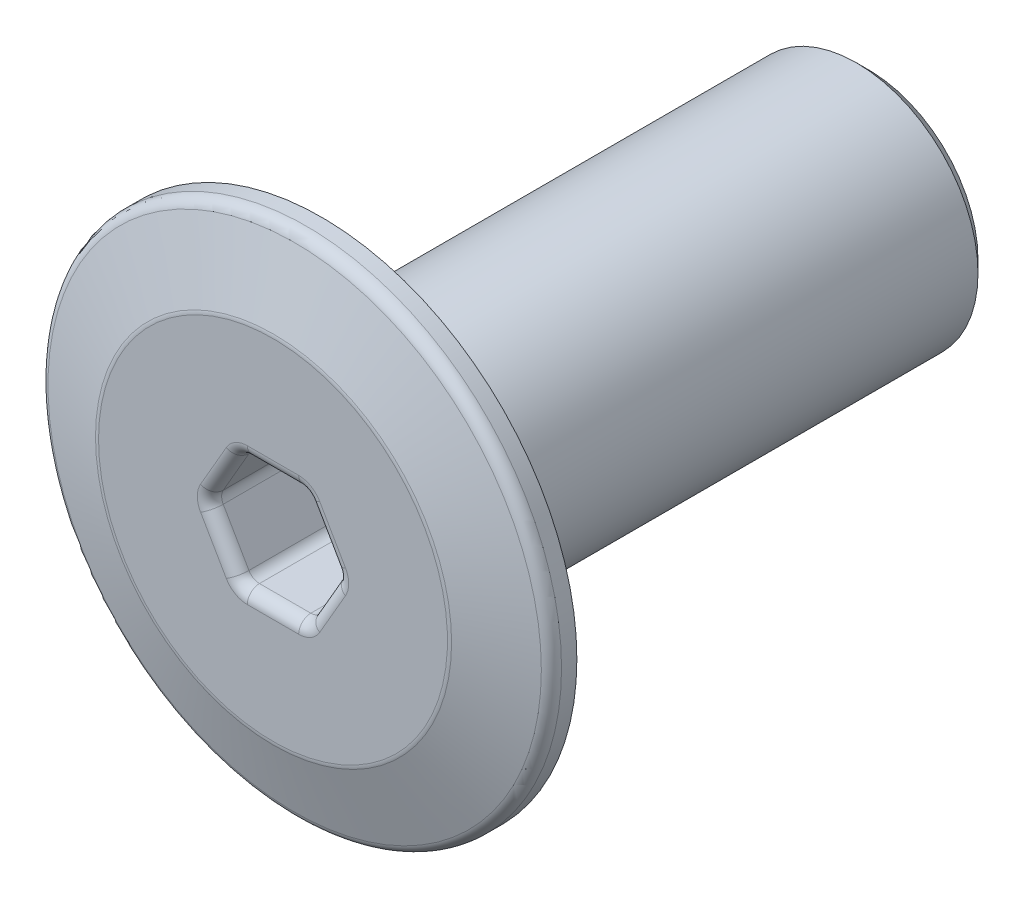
ISO-10303-21;
HEADER;
FILE_DESCRIPTION(('STEP AP214'),'2;1');
FILE_NAME('part.step','',(''),(''),'','','');
FILE_SCHEMA(('AUTOMOTIVE_DESIGN { 1 0 10303 214 1 1 1 1 }'));
ENDSEC;
DATA;
#1=APPLICATION_CONTEXT('core data for automotive mechanical design processes');
#2=APPLICATION_PROTOCOL_DEFINITION('international standard','automotive_design',2000,#1);
#3=PRODUCT_CONTEXT('',#1,'mechanical');
#4=PRODUCT('Part','Part','',(#3));
#5=PRODUCT_RELATED_PRODUCT_CATEGORY('part','',(#4));
#6=PRODUCT_DEFINITION_FORMATION('','',#4);
#7=PRODUCT_DEFINITION_CONTEXT('part definition',#1,'design');
#8=PRODUCT_DEFINITION('design','',#6,#7);
#9=PRODUCT_DEFINITION_SHAPE('','',#8);
#10=(LENGTH_UNIT() NAMED_UNIT(*) SI_UNIT(.MILLI.,.METRE.));
#11=(NAMED_UNIT(*) PLANE_ANGLE_UNIT() SI_UNIT($,.RADIAN.));
#12=(NAMED_UNIT(*) SI_UNIT($,.STERADIAN.) SOLID_ANGLE_UNIT());
#13=UNCERTAINTY_MEASURE_WITH_UNIT(LENGTH_MEASURE(1.E-05),#10,'distance_accuracy_value','');
#14=(GEOMETRIC_REPRESENTATION_CONTEXT(3) GLOBAL_UNCERTAINTY_ASSIGNED_CONTEXT((#13)) GLOBAL_UNIT_ASSIGNED_CONTEXT((#10,
#11,#12)) REPRESENTATION_CONTEXT('',''));
#15=CARTESIAN_POINT('',(0.,0.,0.));
#16=DIRECTION('',(0.,0.,1.));
#17=DIRECTION('',(1.,0.,0.));
#18=AXIS2_PLACEMENT_3D('',#15,#16,#17);
#19=CARTESIAN_POINT('',(1.5849364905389,0.915063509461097,-3.51282051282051));
#20=DIRECTION('',(0.5,-0.866025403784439,0.));
#21=DIRECTION('',(0.866025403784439,0.5,0.));
#22=AXIS2_PLACEMENT_3D('',#19,#20,#21);
#23=CYLINDRICAL_SURFACE('',#22,0.5);
#24=DIRECTION('',(-0.5,0.866025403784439,0.));
#25=VECTOR('',#24,1.);
#26=CARTESIAN_POINT('',(2.01794919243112,1.1650635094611,-3.51282051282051));
#27=LINE('',#26,#25);
#28=CARTESIAN_POINT('',(1.48963702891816,2.08012701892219,-3.51282051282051));
#29=VERTEX_POINT('',#28);
#30=CARTESIAN_POINT('',(2.54626135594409,0.25,-3.51282051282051));
#31=VERTEX_POINT('',#30);
#32=EDGE_CURVE('E353',#29,#31,#27,.F.);
#33=ORIENTED_EDGE('',*,*,#32,.F.);
#34=CARTESIAN_POINT('',(1.05662432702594,1.83012701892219,-3.51282051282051));
#35=DIRECTION('',(0.5,-0.866025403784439,0.));
#36=DIRECTION('',(0.866025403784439,0.5,0.));
#37=AXIS2_PLACEMENT_3D('',#34,#35,#36);
#38=CIRCLE('',#37,0.5);
#39=CARTESIAN_POINT('',(1.05662432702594,1.83012701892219,-4.01282051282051));
#40=VERTEX_POINT('',#39);
#41=EDGE_CURVE('E210',#29,#40,#38,.F.);
#42=ORIENTED_EDGE('',*,*,#41,.T.);
#43=DIRECTION('',(-0.5,0.866025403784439,0.));
#44=VECTOR('',#43,1.);
#45=CARTESIAN_POINT('',(1.5849364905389,0.915063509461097,-4.01282051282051));
#46=LINE('',#45,#44);
#47=CARTESIAN_POINT('',(2.11324865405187,0.,-4.01282051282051));
#48=VERTEX_POINT('',#47);
#49=EDGE_CURVE('E199',#48,#40,#46,.T.);
#50=ORIENTED_EDGE('',*,*,#49,.F.);
#51=CARTESIAN_POINT('',(2.11324865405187,0.,-3.51282051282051));
#52=DIRECTION('',(0.5,-0.866025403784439,0.));
#53=DIRECTION('',(0.866025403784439,0.5,0.));
#54=AXIS2_PLACEMENT_3D('',#51,#52,#53);
#55=CIRCLE('',#54,0.5);
#56=EDGE_CURVE('E207',#48,#31,#55,.T.);
#57=ORIENTED_EDGE('',*,*,#56,.T.);
#58=EDGE_LOOP('',(#33,#42,#50,#57));
#59=FACE_BOUND('',#58,.T.);
#60=ADVANCED_FACE('F36',(#59),#23,.F.);
#61=CARTESIAN_POINT('',(1.5849364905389,-0.915063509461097,-3.51282051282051));
#62=DIRECTION('',(-0.5,-0.866025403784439,0.));
#63=DIRECTION('',(0.866025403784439,-0.5,0.));
#64=AXIS2_PLACEMENT_3D('',#61,#62,#63);
#65=CYLINDRICAL_SURFACE('',#64,0.5);
#66=DIRECTION('',(0.5,0.866025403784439,0.));
#67=VECTOR('',#66,1.);
#68=CARTESIAN_POINT('',(2.01794919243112,-1.1650635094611,-3.51282051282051));
#69=LINE('',#68,#67);
#70=CARTESIAN_POINT('',(2.54626135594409,-0.249999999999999,-3.51282051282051));
#71=VERTEX_POINT('',#70);
#72=CARTESIAN_POINT('',(1.48963702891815,-2.08012701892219,-3.51282051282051));
#73=VERTEX_POINT('',#72);
#74=EDGE_CURVE('E185',#71,#73,#69,.F.);
#75=ORIENTED_EDGE('',*,*,#74,.F.);
#76=CARTESIAN_POINT('',(2.11324865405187,0.,-3.51282051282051));
#77=DIRECTION('',(-0.5,-0.866025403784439,0.));
#78=DIRECTION('',(0.866025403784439,-0.5,0.));
#79=AXIS2_PLACEMENT_3D('',#76,#77,#78);
#80=CIRCLE('',#79,0.5);
#81=EDGE_CURVE('E179',#71,#48,#80,.F.);
#82=ORIENTED_EDGE('',*,*,#81,.T.);
#83=DIRECTION('',(0.5,0.866025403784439,0.));
#84=VECTOR('',#83,1.);
#85=CARTESIAN_POINT('',(1.5849364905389,-0.915063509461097,-4.01282051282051));
#86=LINE('',#85,#84);
#87=CARTESIAN_POINT('',(1.05662432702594,-1.83012701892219,-4.01282051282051));
#88=VERTEX_POINT('',#87);
#89=EDGE_CURVE('E182',#88,#48,#86,.T.);
#90=ORIENTED_EDGE('',*,*,#89,.F.);
#91=CARTESIAN_POINT('',(1.05662432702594,-1.83012701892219,-3.51282051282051));
#92=DIRECTION('',(-0.5,-0.866025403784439,0.));
#93=DIRECTION('',(0.866025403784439,-0.5,0.));
#94=AXIS2_PLACEMENT_3D('',#91,#92,#93);
#95=CIRCLE('',#94,0.5);
#96=EDGE_CURVE('E191',#88,#73,#95,.T.);
#97=ORIENTED_EDGE('',*,*,#96,.T.);
#98=EDGE_LOOP('',(#75,#82,#90,#97));
#99=FACE_BOUND('',#98,.T.);
#100=ADVANCED_FACE('F181',(#99),#65,.F.);
#101=CARTESIAN_POINT('',(0.,-1.83012701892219,-3.51282051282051));
#102=DIRECTION('',(-1.,0.,0.));
#103=DIRECTION('',(0.,0.,1.));
#104=AXIS2_PLACEMENT_3D('',#101,#102,#103);
#105=CYLINDRICAL_SURFACE('',#104,0.5);
#106=DIRECTION('',(1.,0.,0.));
#107=VECTOR('',#106,1.);
#108=CARTESIAN_POINT('',(0.,-2.33012701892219,-3.51282051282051));
#109=LINE('',#108,#107);
#110=CARTESIAN_POINT('',(1.05662432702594,-2.33012701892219,-3.51282051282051));
#111=VERTEX_POINT('',#110);
#112=CARTESIAN_POINT('',(-1.05662432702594,-2.33012701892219,-3.51282051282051));
#113=VERTEX_POINT('',#112);
#114=EDGE_CURVE('E349',#111,#113,#109,.F.);
#115=ORIENTED_EDGE('',*,*,#114,.F.);
#116=CARTESIAN_POINT('',(1.05662432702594,-1.83012701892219,-3.51282051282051));
#117=DIRECTION('',(-1.,0.,0.));
#118=DIRECTION('',(0.,0.,1.));
#119=AXIS2_PLACEMENT_3D('',#116,#117,#118);
#120=CIRCLE('',#119,0.5);
#121=EDGE_CURVE('E226',#111,#88,#120,.F.);
#122=ORIENTED_EDGE('',*,*,#121,.T.);
#123=DIRECTION('',(1.,0.,0.));
#124=VECTOR('',#123,1.);
#125=CARTESIAN_POINT('',(0.,-1.83012701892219,-4.01282051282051));
#126=LINE('',#125,#124);
#127=CARTESIAN_POINT('',(-1.05662432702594,-1.83012701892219,-4.01282051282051));
#128=VERTEX_POINT('',#127);
#129=EDGE_CURVE('E203',#128,#88,#126,.T.);
#130=ORIENTED_EDGE('',*,*,#129,.F.);
#131=CARTESIAN_POINT('',(-1.05662432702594,-1.83012701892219,-3.51282051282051));
#132=DIRECTION('',(-1.,0.,0.));
#133=DIRECTION('',(0.,0.,1.));
#134=AXIS2_PLACEMENT_3D('',#131,#132,#133);
#135=CIRCLE('',#134,0.5);
#136=EDGE_CURVE('E190',#128,#113,#135,.T.);
#137=ORIENTED_EDGE('',*,*,#136,.T.);
#138=EDGE_LOOP('',(#115,#122,#130,#137));
#139=FACE_BOUND('',#138,.T.);
#140=ADVANCED_FACE('F493',(#139),#105,.F.);
#141=CARTESIAN_POINT('',(-1.58493649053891,-0.915063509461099,-3.51282051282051));
#142=DIRECTION('',(-0.5,0.866025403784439,0.));
#143=DIRECTION('',(-0.866025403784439,-0.5,0.));
#144=AXIS2_PLACEMENT_3D('',#141,#142,#143);
#145=CYLINDRICAL_SURFACE('',#144,0.5);
#146=DIRECTION('',(0.5,-0.866025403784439,0.));
#147=VECTOR('',#146,1.);
#148=CARTESIAN_POINT('',(-2.01794919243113,-1.1650635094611,-3.51282051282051));
#149=LINE('',#148,#147);
#150=CARTESIAN_POINT('',(-1.48963702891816,-2.08012701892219,-3.51282051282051));
#151=VERTEX_POINT('',#150);
#152=CARTESIAN_POINT('',(-2.54626135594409,-0.250000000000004,-3.51282051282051));
#153=VERTEX_POINT('',#152);
#154=EDGE_CURVE('E346',#151,#153,#149,.F.);
#155=ORIENTED_EDGE('',*,*,#154,.F.);
#156=CARTESIAN_POINT('',(-1.05662432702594,-1.83012701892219,-3.51282051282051));
#157=DIRECTION('',(-0.5,0.866025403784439,0.));
#158=DIRECTION('',(-0.866025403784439,-0.5,0.));
#159=AXIS2_PLACEMENT_3D('',#156,#157,#158);
#160=CIRCLE('',#159,0.5);
#161=EDGE_CURVE('E230',#151,#128,#160,.F.);
#162=ORIENTED_EDGE('',*,*,#161,.T.);
#163=DIRECTION('',(0.5,-0.866025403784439,0.));
#164=VECTOR('',#163,1.);
#165=CARTESIAN_POINT('',(-1.58493649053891,-0.915063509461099,-4.01282051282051));
#166=LINE('',#165,#164);
#167=CARTESIAN_POINT('',(-2.11324865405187,0.,-4.01282051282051));
#168=VERTEX_POINT('',#167);
#169=EDGE_CURVE('E334',#168,#128,#166,.T.);
#170=ORIENTED_EDGE('',*,*,#169,.F.);
#171=CARTESIAN_POINT('',(-2.11324865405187,0.,-3.51282051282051));
#172=DIRECTION('',(-0.5,0.866025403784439,0.));
#173=DIRECTION('',(-0.866025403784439,-0.5,0.));
#174=AXIS2_PLACEMENT_3D('',#171,#172,#173);
#175=CIRCLE('',#174,0.5);
#176=EDGE_CURVE('E228',#168,#153,#175,.T.);
#177=ORIENTED_EDGE('',*,*,#176,.T.);
#178=EDGE_LOOP('',(#155,#162,#170,#177));
#179=FACE_BOUND('',#178,.T.);
#180=ADVANCED_FACE('F475',(#179),#145,.F.);
#181=CARTESIAN_POINT('',(-1.5849364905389,0.915063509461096,-3.51282051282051));
#182=DIRECTION('',(0.5,0.866025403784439,0.));
#183=DIRECTION('',(-0.866025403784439,0.5,0.));
#184=AXIS2_PLACEMENT_3D('',#181,#182,#183);
#185=CYLINDRICAL_SURFACE('',#184,0.5);
#186=DIRECTION('',(-0.5,-0.866025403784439,0.));
#187=VECTOR('',#186,1.);
#188=CARTESIAN_POINT('',(-1.5849364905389,0.915063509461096,-4.01282051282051));
#189=LINE('',#188,#187);
#190=CARTESIAN_POINT('',(-1.05662432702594,1.83012701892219,-4.01282051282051));
#191=VERTEX_POINT('',#190);
#192=EDGE_CURVE('E336',#191,#168,#189,.T.);
#193=ORIENTED_EDGE('',*,*,#192,.F.);
#194=CARTESIAN_POINT('',(-1.05662432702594,1.83012701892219,-3.51282051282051));
#195=DIRECTION('',(0.5,0.866025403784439,0.));
#196=DIRECTION('',(-0.866025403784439,0.5,0.));
#197=AXIS2_PLACEMENT_3D('',#194,#195,#196);
#198=CIRCLE('',#197,0.5);
#199=CARTESIAN_POINT('',(-1.48963702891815,2.08012701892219,-3.51282051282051));
#200=VERTEX_POINT('',#199);
#201=EDGE_CURVE('E422',#191,#200,#198,.T.);
#202=ORIENTED_EDGE('',*,*,#201,.T.);
#203=DIRECTION('',(-0.5,-0.866025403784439,0.));
#204=VECTOR('',#203,1.);
#205=CARTESIAN_POINT('',(-2.01794919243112,1.1650635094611,-3.51282051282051));
#206=LINE('',#205,#204);
#207=CARTESIAN_POINT('',(-2.54626135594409,0.249999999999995,-3.51282051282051));
#208=VERTEX_POINT('',#207);
#209=EDGE_CURVE('E343',#208,#200,#206,.F.);
#210=ORIENTED_EDGE('',*,*,#209,.F.);
#211=CARTESIAN_POINT('',(-2.11324865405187,0.,-3.51282051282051));
#212=DIRECTION('',(0.5,0.866025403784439,0.));
#213=DIRECTION('',(-0.866025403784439,0.5,0.));
#214=AXIS2_PLACEMENT_3D('',#211,#212,#213);
#215=CIRCLE('',#214,0.5);
#216=EDGE_CURVE('E420',#208,#168,#215,.F.);
#217=ORIENTED_EDGE('',*,*,#216,.T.);
#218=EDGE_LOOP('',(#193,#202,#210,#217));
#219=FACE_BOUND('',#218,.T.);
#220=ADVANCED_FACE('F457',(#219),#185,.F.);
#221=CARTESIAN_POINT('',(0.,1.83012701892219,-3.51282051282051));
#222=DIRECTION('',(1.,0.,0.));
#223=DIRECTION('',(0.,0.,-1.));
#224=AXIS2_PLACEMENT_3D('',#221,#222,#223);
#225=CYLINDRICAL_SURFACE('',#224,0.5);
#226=DIRECTION('',(-1.,0.,0.));
#227=VECTOR('',#226,1.);
#228=CARTESIAN_POINT('',(0.,2.33012701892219,-3.51282051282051));
#229=LINE('',#228,#227);
#230=CARTESIAN_POINT('',(-1.05662432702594,2.33012701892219,-3.51282051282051));
#231=VERTEX_POINT('',#230);
#232=CARTESIAN_POINT('',(1.05662432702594,2.33012701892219,-3.51282051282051));
#233=VERTEX_POINT('',#232);
#234=EDGE_CURVE('E341',#231,#233,#229,.F.);
#235=ORIENTED_EDGE('',*,*,#234,.F.);
#236=CARTESIAN_POINT('',(-1.05662432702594,1.83012701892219,-3.51282051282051));
#237=DIRECTION('',(1.,0.,0.));
#238=DIRECTION('',(0.,0.,-1.));
#239=AXIS2_PLACEMENT_3D('',#236,#237,#238);
#240=CIRCLE('',#239,0.5);
#241=EDGE_CURVE('E217',#231,#191,#240,.F.);
#242=ORIENTED_EDGE('',*,*,#241,.T.);
#243=DIRECTION('',(-1.,0.,0.));
#244=VECTOR('',#243,1.);
#245=CARTESIAN_POINT('',(0.,1.83012701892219,-4.01282051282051));
#246=LINE('',#245,#244);
#247=EDGE_CURVE('E339',#40,#191,#246,.T.);
#248=ORIENTED_EDGE('',*,*,#247,.F.);
#249=CARTESIAN_POINT('',(1.05662432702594,1.83012701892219,-3.51282051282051));
#250=DIRECTION('',(1.,0.,0.));
#251=DIRECTION('',(0.,0.,-1.));
#252=AXIS2_PLACEMENT_3D('',#249,#250,#251);
#253=CIRCLE('',#252,0.5);
#254=EDGE_CURVE('E220',#40,#233,#253,.T.);
#255=ORIENTED_EDGE('',*,*,#254,.T.);
#256=EDGE_LOOP('',(#235,#242,#248,#255));
#257=FACE_BOUND('',#256,.T.);
#258=ADVANCED_FACE('F425',(#257),#225,.F.);
#259=CARTESIAN_POINT('',(0.,0.,-23.5128205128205));
#260=DIRECTION('',(0.,0.,1.));
#261=DIRECTION('',(1.,0.,0.));
#262=AXIS2_PLACEMENT_3D('',#259,#260,#261);
#263=PLANE('',#262);
#264=CARTESIAN_POINT('',(0.,0.,-23.5128205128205));
#265=DIRECTION('',(0.,0.,1.));
#266=DIRECTION('',(1.,0.,0.));
#267=AXIS2_PLACEMENT_3D('',#264,#265,#266);
#268=CIRCLE('',#267,4.49999999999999);
#269=CARTESIAN_POINT('',(4.49999999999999,0.,-23.5128205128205));
#270=VERTEX_POINT('',#269);
#271=EDGE_CURVE('E212',#270,#270,#268,.F.);
#272=ORIENTED_EDGE('',*,*,#271,.T.);
#273=EDGE_LOOP('',(#272));
#274=FACE_BOUND('',#273,.T.);
#275=ADVANCED_FACE('F564',(#274),#263,.F.);
#276=CARTESIAN_POINT('',(0.,0.,0.));
#277=DIRECTION('',(0.,0.,1.));
#278=DIRECTION('',(1.,0.,0.));
#279=AXIS2_PLACEMENT_3D('',#276,#277,#278);
#280=CYLINDRICAL_SURFACE('',#279,5.);
#281=CARTESIAN_POINT('',(0.,0.,-23.0128205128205));
#282=DIRECTION('',(0.,0.,1.));
#283=DIRECTION('',(1.,0.,0.));
#284=AXIS2_PLACEMENT_3D('',#281,#282,#283);
#285=CIRCLE('',#284,5.);
#286=CARTESIAN_POINT('',(5.,0.,-23.0128205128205));
#287=VERTEX_POINT('',#286);
#288=EDGE_CURVE('E328',#287,#287,#285,.T.);
#289=ORIENTED_EDGE('',*,*,#288,.T.);
#290=EDGE_LOOP('',(#289));
#291=FACE_BOUND('',#290,.T.);
#292=CARTESIAN_POINT('',(0.,0.,-1.51282051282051));
#293=DIRECTION('',(0.,0.,1.));
#294=DIRECTION('',(1.,0.,0.));
#295=AXIS2_PLACEMENT_3D('',#292,#293,#294);
#296=CIRCLE('',#295,5.);
#297=CARTESIAN_POINT('',(5.,0.,-1.51282051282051));
#298=VERTEX_POINT('',#297);
#299=EDGE_CURVE('E325',#298,#298,#296,.T.);
#300=ORIENTED_EDGE('',*,*,#299,.F.);
#301=EDGE_LOOP('',(#300));
#302=FACE_BOUND('',#301,.T.);
#303=ADVANCED_FACE('F571',(#291,#302),#280,.T.);
#304=CARTESIAN_POINT('',(0.,6.,-1.51282051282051));
#305=DIRECTION('',(0.,0.,1.));
#306=DIRECTION('',(1.,0.,0.));
#307=AXIS2_PLACEMENT_3D('',#304,#305,#306);
#308=PLANE('',#307);
#309=CARTESIAN_POINT('',(0.,0.,-1.51282051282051));
#310=DIRECTION('',(0.,0.,1.));
#311=DIRECTION('',(1.,0.,0.));
#312=AXIS2_PLACEMENT_3D('',#309,#310,#311);
#313=CIRCLE('',#312,6.);
#314=CARTESIAN_POINT('',(6.,0.,-1.51282051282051));
#315=VERTEX_POINT('',#314);
#316=EDGE_CURVE('E320',#315,#315,#313,.T.);
#317=ORIENTED_EDGE('',*,*,#316,.F.);
#318=EDGE_LOOP('',(#317));
#319=FACE_BOUND('',#318,.T.);
#320=ORIENTED_EDGE('',*,*,#299,.T.);
#321=EDGE_LOOP('',(#320));
#322=FACE_BOUND('',#321,.T.);
#323=ADVANCED_FACE('F575',(#319,#322),#308,.F.);
#324=CARTESIAN_POINT('',(0.,0.,0.));
#325=DIRECTION('',(0.,0.,1.));
#326=DIRECTION('',(1.,0.,0.));
#327=AXIS2_PLACEMENT_3D('',#324,#325,#326);
#328=CYLINDRICAL_SURFACE('',#327,6.);
#329=CARTESIAN_POINT('',(0.,0.,-1.01282051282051));
#330=DIRECTION('',(0.,0.,1.));
#331=DIRECTION('',(1.,0.,0.));
#332=AXIS2_PLACEMENT_3D('',#329,#330,#331);
#333=CIRCLE('',#332,6.);
#334=CARTESIAN_POINT('',(6.,0.,-1.01282051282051));
#335=VERTEX_POINT('',#334);
#336=EDGE_CURVE('E315',#335,#335,#333,.T.);
#337=ORIENTED_EDGE('',*,*,#336,.F.);
#338=EDGE_LOOP('',(#337));
#339=FACE_BOUND('',#338,.T.);
#340=ORIENTED_EDGE('',*,*,#316,.T.);
#341=EDGE_LOOP('',(#340));
#342=FACE_BOUND('',#341,.T.);
#343=ADVANCED_FACE('F579',(#339,#342),#328,.T.);
#344=CARTESIAN_POINT('',(0.,6.,-1.01282051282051));
#345=DIRECTION('',(0.,0.,1.));
#346=DIRECTION('',(1.,0.,0.));
#347=AXIS2_PLACEMENT_3D('',#344,#345,#346);
#348=PLANE('',#347);
#349=CARTESIAN_POINT('',(0.,0.,-1.01282051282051));
#350=DIRECTION('',(0.,0.,1.));
#351=DIRECTION('',(1.,0.,0.));
#352=AXIS2_PLACEMENT_3D('',#349,#350,#351);
#353=CIRCLE('',#352,10.5);
#354=CARTESIAN_POINT('',(10.5,0.,-1.01282051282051));
#355=VERTEX_POINT('',#354);
#356=EDGE_CURVE('E310',#355,#355,#353,.T.);
#357=ORIENTED_EDGE('',*,*,#356,.F.);
#358=EDGE_LOOP('',(#357));
#359=FACE_BOUND('',#358,.T.);
#360=ORIENTED_EDGE('',*,*,#336,.T.);
#361=EDGE_LOOP('',(#360));
#362=FACE_BOUND('',#361,.T.);
#363=ADVANCED_FACE('F583',(#359,#362),#348,.F.);
#364=CARTESIAN_POINT('',(0.,0.,0.));
#365=DIRECTION('',(0.,0.,1.));
#366=DIRECTION('',(1.,0.,0.));
#367=AXIS2_PLACEMENT_3D('',#364,#365,#366);
#368=CYLINDRICAL_SURFACE('',#367,10.5);
#369=CARTESIAN_POINT('',(0.,0.,-0.382036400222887));
#370=DIRECTION('',(0.,0.,-1.));
#371=DIRECTION('',(-1.,0.,0.));
#372=AXIS2_PLACEMENT_3D('',#369,#370,#371);
#373=CIRCLE('',#372,10.5);
#374=CARTESIAN_POINT('',(-10.5,0.,-0.382036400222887));
#375=VERTEX_POINT('',#374);
#376=EDGE_CURVE('E238',#375,#375,#373,.T.);
#377=ORIENTED_EDGE('',*,*,#376,.T.);
#378=EDGE_LOOP('',(#377));
#379=FACE_BOUND('',#378,.T.);
#380=ORIENTED_EDGE('',*,*,#356,.T.);
#381=EDGE_LOOP('',(#380));
#382=FACE_BOUND('',#381,.T.);
#383=ADVANCED_FACE('F587',(#379,#382),#368,.T.);
#384=CARTESIAN_POINT('',(0.,0.,-0.0128205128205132));
#385=DIRECTION('',(0.,0.,-1.));
#386=DIRECTION('',(-1.,0.,0.));
#387=AXIS2_PLACEMENT_3D('',#384,#385,#386);
#388=CONICAL_SURFACE('',#387,10.5,1.27211248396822);
#389=CARTESIAN_POINT('',(0.,0.,0.0958259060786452));
#390=DIRECTION('',(0.,0.,1.));
#391=DIRECTION('',(1.,0.,0.));
#392=AXIS2_PLACEMENT_3D('',#389,#390,#391);
#393=CIRCLE('',#392,10.1471312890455);
#394=CARTESIAN_POINT('',(10.1471312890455,0.,0.0958259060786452));
#395=VERTEX_POINT('',#394);
#396=EDGE_CURVE('E235',#395,#395,#393,.T.);
#397=ORIENTED_EDGE('',*,*,#396,.T.);
#398=EDGE_LOOP('',(#397));
#399=FACE_BOUND('',#398,.T.);
#400=CARTESIAN_POINT('',(0.,0.,0.965041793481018));
#401=DIRECTION('',(0.,0.,1.));
#402=DIRECTION('',(1.,0.,0.));
#403=AXIS2_PLACEMENT_3D('',#400,#401,#402);
#404=CIRCLE('',#403,7.32403695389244);
#405=CARTESIAN_POINT('',(7.32403695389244,0.,0.965041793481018));
#406=VERTEX_POINT('',#405);
#407=EDGE_CURVE('E232',#406,#406,#404,.F.);
#408=ORIENTED_EDGE('',*,*,#407,.T.);
#409=EDGE_LOOP('',(#408));
#410=FACE_BOUND('',#409,.T.);
#411=ADVANCED_FACE('F591',(#399,#410),#388,.T.);
#412=CARTESIAN_POINT('',(0.,7.25213675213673,0.987179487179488));
#413=DIRECTION('',(0.,0.,-1.));
#414=DIRECTION('',(-1.,0.,0.));
#415=AXIS2_PLACEMENT_3D('',#412,#413,#414);
#416=PLANE('',#415);
#417=CARTESIAN_POINT('',(0.,0.,0.987179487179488));
#418=DIRECTION('',(0.,0.,-1.));
#419=DIRECTION('',(-1.,0.,0.));
#420=AXIS2_PLACEMENT_3D('',#417,#418,#419);
#421=CIRCLE('',#420,7.17690566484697);
#422=CARTESIAN_POINT('',(-7.17690566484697,0.,0.987179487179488));
#423=VERTEX_POINT('',#422);
#424=EDGE_CURVE('E393',#423,#423,#421,.F.);
#425=ORIENTED_EDGE('',*,*,#424,.T.);
#426=EDGE_LOOP('',(#425));
#427=FACE_BOUND('',#426,.T.);
#428=CARTESIAN_POINT('',(2.11324865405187,0.,0.987179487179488));
#429=DIRECTION('',(0.,0.,-1.));
#430=DIRECTION('',(-1.,0.,0.));
#431=AXIS2_PLACEMENT_3D('',#428,#429,#430);
#432=CIRCLE('',#431,1.);
#433=CARTESIAN_POINT('',(2.97927405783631,-0.499999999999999,0.987179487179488));
#434=VERTEX_POINT('',#433);
#435=CARTESIAN_POINT('',(2.97927405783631,0.500000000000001,0.987179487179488));
#436=VERTEX_POINT('',#435);
#437=EDGE_CURVE('E385',#434,#436,#432,.F.);
#438=ORIENTED_EDGE('',*,*,#437,.F.);
#439=DIRECTION('',(0.5,0.866025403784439,0.));
#440=VECTOR('',#439,1.);
#441=CARTESIAN_POINT('',(5.59122922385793,4.02403905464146,0.987179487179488));
#442=LINE('',#441,#440);
#443=CARTESIAN_POINT('',(1.92264973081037,-2.33012701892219,0.987179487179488));
#444=VERTEX_POINT('',#443);
#445=EDGE_CURVE('E391',#434,#444,#442,.F.);
#446=ORIENTED_EDGE('',*,*,#445,.T.);
#447=CARTESIAN_POINT('',(1.05662432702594,-1.83012701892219,0.987179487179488));
#448=DIRECTION('',(0.,0.,-1.));
#449=DIRECTION('',(-1.,0.,0.));
#450=AXIS2_PLACEMENT_3D('',#447,#448,#449);
#451=CIRCLE('',#450,1.);
#452=CARTESIAN_POINT('',(1.05662432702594,-2.83012701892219,0.987179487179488));
#453=VERTEX_POINT('',#452);
#454=EDGE_CURVE('E388',#453,#444,#451,.F.);
#455=ORIENTED_EDGE('',*,*,#454,.F.);
#456=DIRECTION('',(1.,0.,0.));
#457=VECTOR('',#456,1.);
#458=CARTESIAN_POINT('',(0.,-2.83012701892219,0.987179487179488));
#459=LINE('',#458,#457);
#460=CARTESIAN_POINT('',(-1.05662432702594,-2.83012701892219,0.987179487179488));
#461=VERTEX_POINT('',#460);
#462=EDGE_CURVE('E382',#453,#461,#459,.F.);
#463=ORIENTED_EDGE('',*,*,#462,.T.);
#464=CARTESIAN_POINT('',(-1.05662432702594,-1.83012701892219,0.987179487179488));
#465=DIRECTION('',(0.,0.,-1.));
#466=DIRECTION('',(-1.,0.,0.));
#467=AXIS2_PLACEMENT_3D('',#464,#465,#466);
#468=CIRCLE('',#467,1.);
#469=CARTESIAN_POINT('',(-1.92264973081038,-2.33012701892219,0.987179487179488));
#470=VERTEX_POINT('',#469);
#471=EDGE_CURVE('E379',#470,#461,#468,.F.);
#472=ORIENTED_EDGE('',*,*,#471,.F.);
#473=DIRECTION('',(0.5,-0.866025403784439,0.));
#474=VECTOR('',#473,1.);
#475=CARTESIAN_POINT('',(-5.59122922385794,4.02403905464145,0.987179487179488));
#476=LINE('',#475,#474);
#477=CARTESIAN_POINT('',(-2.97927405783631,-0.500000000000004,0.987179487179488));
#478=VERTEX_POINT('',#477);
#479=EDGE_CURVE('E377',#470,#478,#476,.F.);
#480=ORIENTED_EDGE('',*,*,#479,.T.);
#481=CARTESIAN_POINT('',(-2.11324865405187,0.,0.987179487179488));
#482=DIRECTION('',(0.,0.,-1.));
#483=DIRECTION('',(-1.,0.,0.));
#484=AXIS2_PLACEMENT_3D('',#481,#482,#483);
#485=CIRCLE('',#484,1.);
#486=CARTESIAN_POINT('',(-2.97927405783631,0.499999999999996,0.987179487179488));
#487=VERTEX_POINT('',#486);
#488=EDGE_CURVE('E374',#487,#478,#485,.F.);
#489=ORIENTED_EDGE('',*,*,#488,.F.);
#490=DIRECTION('',(-0.5,-0.866025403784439,0.));
#491=VECTOR('',#490,1.);
#492=CARTESIAN_POINT('',(0.68930543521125,6.85416607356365,0.987179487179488));
#493=LINE('',#492,#491);
#494=CARTESIAN_POINT('',(-1.92264973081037,2.33012701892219,0.987179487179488));
#495=VERTEX_POINT('',#494);
#496=EDGE_CURVE('E370',#487,#495,#493,.F.);
#497=ORIENTED_EDGE('',*,*,#496,.T.);
#498=CARTESIAN_POINT('',(-1.05662432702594,1.83012701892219,0.987179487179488));
#499=DIRECTION('',(0.,0.,-1.));
#500=DIRECTION('',(-1.,0.,0.));
#501=AXIS2_PLACEMENT_3D('',#498,#499,#500);
#502=CIRCLE('',#501,1.);
#503=CARTESIAN_POINT('',(-1.05662432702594,2.83012701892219,0.987179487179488));
#504=VERTEX_POINT('',#503);
#505=EDGE_CURVE('E367',#504,#495,#502,.F.);
#506=ORIENTED_EDGE('',*,*,#505,.F.);
#507=DIRECTION('',(-1.,0.,0.));
#508=VECTOR('',#507,1.);
#509=CARTESIAN_POINT('',(0.,2.83012701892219,0.987179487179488));
#510=LINE('',#509,#508);
#511=CARTESIAN_POINT('',(1.05662432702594,2.83012701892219,0.987179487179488));
#512=VERTEX_POINT('',#511);
#513=EDGE_CURVE('E365',#504,#512,#510,.F.);
#514=ORIENTED_EDGE('',*,*,#513,.T.);
#515=CARTESIAN_POINT('',(1.05662432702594,1.83012701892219,0.987179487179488));
#516=DIRECTION('',(0.,0.,-1.));
#517=DIRECTION('',(-1.,0.,0.));
#518=AXIS2_PLACEMENT_3D('',#515,#516,#517);
#519=CIRCLE('',#518,1.);
#520=CARTESIAN_POINT('',(1.92264973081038,2.33012701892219,0.987179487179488));
#521=VERTEX_POINT('',#520);
#522=EDGE_CURVE('E362',#521,#512,#519,.F.);
#523=ORIENTED_EDGE('',*,*,#522,.F.);
#524=DIRECTION('',(-0.5,0.866025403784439,0.));
#525=VECTOR('',#524,1.);
#526=CARTESIAN_POINT('',(-0.689305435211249,6.85416607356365,0.987179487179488));
#527=LINE('',#526,#525);
#528=EDGE_CURVE('E372',#521,#436,#527,.F.);
#529=ORIENTED_EDGE('',*,*,#528,.T.);
#530=EDGE_LOOP('',(#438,#446,#455,#463,#472,#480,#489,#497,#506,#514,#523,#529));
#531=FACE_BOUND('',#530,.T.);
#532=ADVANCED_FACE('F523',(#427,#531),#416,.F.);
#533=CARTESIAN_POINT('',(0.,0.,-23.0128205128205));
#534=DIRECTION('',(0.,0.,1.));
#535=DIRECTION('',(1.,0.,0.));
#536=AXIS2_PLACEMENT_3D('',#533,#534,#535);
#537=CONICAL_SURFACE('',#536,5.,0.785398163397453);
#538=ORIENTED_EDGE('',*,*,#271,.F.);
#539=EDGE_LOOP('',(#538));
#540=FACE_BOUND('',#539,.T.);
#541=ORIENTED_EDGE('',*,*,#288,.F.);
#542=EDGE_LOOP('',(#541));
#543=FACE_BOUND('',#542,.T.);
#544=ADVANCED_FACE('F565',(#540,#543),#537,.T.);
#545=CARTESIAN_POINT('',(-1.34529946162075,-2.33012701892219,-4.01282051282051));
#546=DIRECTION('',(-0.866025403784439,-0.5,0.));
#547=DIRECTION('',(0.5,-0.866025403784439,0.));
#548=AXIS2_PLACEMENT_3D('',#545,#546,#547);
#549=PLANE('',#548);
#550=DIRECTION('',(0.5,-0.866025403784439,0.));
#551=VECTOR('',#550,1.);
#552=CARTESIAN_POINT('',(-1.34529946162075,-2.33012701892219,0.487179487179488));
#553=LINE('',#552,#551);
#554=CARTESIAN_POINT('',(-2.54626135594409,-0.250000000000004,0.487179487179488));
#555=VERTEX_POINT('',#554);
#556=CARTESIAN_POINT('',(-1.48963702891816,-2.08012701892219,0.487179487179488));
#557=VERTEX_POINT('',#556);
#558=EDGE_CURVE('E404',#555,#557,#553,.T.);
#559=ORIENTED_EDGE('',*,*,#558,.T.);
#560=DIRECTION('',(0.,0.,1.));
#561=VECTOR('',#560,1.);
#562=CARTESIAN_POINT('',(-1.48963702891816,-2.08012701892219,-3.51282051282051));
#563=LINE('',#562,#561);
#564=EDGE_CURVE('E406',#557,#151,#563,.F.);
#565=ORIENTED_EDGE('',*,*,#564,.T.);
#566=ORIENTED_EDGE('',*,*,#154,.T.);
#567=DIRECTION('',(0.,0.,1.));
#568=VECTOR('',#567,1.);
#569=CARTESIAN_POINT('',(-2.54626135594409,-0.250000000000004,0.987179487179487));
#570=LINE('',#569,#568);
#571=EDGE_CURVE('E402',#153,#555,#570,.T.);
#572=ORIENTED_EDGE('',*,*,#571,.T.);
#573=EDGE_LOOP('',(#559,#565,#566,#572));
#574=FACE_BOUND('',#573,.T.);
#575=ADVANCED_FACE('F469',(#574),#549,.F.);
#576=CARTESIAN_POINT('',(-2.6905989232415,0.,-4.01282051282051));
#577=DIRECTION('',(-0.866025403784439,0.5,0.));
#578=DIRECTION('',(-0.5,-0.866025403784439,0.));
#579=AXIS2_PLACEMENT_3D('',#576,#577,#578);
#580=PLANE('',#579);
#581=ORIENTED_EDGE('',*,*,#209,.T.);
#582=DIRECTION('',(0.,0.,1.));
#583=VECTOR('',#582,1.);
#584=CARTESIAN_POINT('',(-1.48963702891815,2.08012701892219,0.987179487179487));
#585=LINE('',#584,#583);
#586=CARTESIAN_POINT('',(-1.48963702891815,2.08012701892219,0.487179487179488));
#587=VERTEX_POINT('',#586);
#588=EDGE_CURVE('E418',#200,#587,#585,.T.);
#589=ORIENTED_EDGE('',*,*,#588,.T.);
#590=DIRECTION('',(-0.5,-0.866025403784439,0.));
#591=VECTOR('',#590,1.);
#592=CARTESIAN_POINT('',(-2.6905989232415,0.,0.487179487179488));
#593=LINE('',#592,#591);
#594=CARTESIAN_POINT('',(-2.54626135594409,0.249999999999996,0.487179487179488));
#595=VERTEX_POINT('',#594);
#596=EDGE_CURVE('E416',#587,#595,#593,.T.);
#597=ORIENTED_EDGE('',*,*,#596,.T.);
#598=DIRECTION('',(0.,0.,1.));
#599=VECTOR('',#598,1.);
#600=CARTESIAN_POINT('',(-2.54626135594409,0.249999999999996,-3.51282051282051));
#601=LINE('',#600,#599);
#602=EDGE_CURVE('E414',#595,#208,#601,.F.);
#603=ORIENTED_EDGE('',*,*,#602,.T.);
#604=EDGE_LOOP('',(#581,#589,#597,#603));
#605=FACE_BOUND('',#604,.T.);
#606=ADVANCED_FACE('F447',(#605),#580,.F.);
#607=CARTESIAN_POINT('',(-1.34529946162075,2.33012701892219,-4.01282051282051));
#608=DIRECTION('',(0.,1.,0.));
#609=DIRECTION('',(0.,0.,1.));
#610=AXIS2_PLACEMENT_3D('',#607,#608,#609);
#611=PLANE('',#610);
#612=DIRECTION('',(-1.,0.,0.));
#613=VECTOR('',#612,1.);
#614=CARTESIAN_POINT('',(-1.34529946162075,2.33012701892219,0.487179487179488));
#615=LINE('',#614,#613);
#616=CARTESIAN_POINT('',(1.05662432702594,2.33012701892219,0.487179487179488));
#617=VERTEX_POINT('',#616);
#618=CARTESIAN_POINT('',(-1.05662432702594,2.33012701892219,0.487179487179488));
#619=VERTEX_POINT('',#618);
#620=EDGE_CURVE('E45',#617,#619,#615,.T.);
#621=ORIENTED_EDGE('',*,*,#620,.T.);
#622=DIRECTION('',(0.,0.,1.));
#623=VECTOR('',#622,1.);
#624=CARTESIAN_POINT('',(-1.05662432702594,2.33012701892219,-3.51282051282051));
#625=LINE('',#624,#623);
#626=EDGE_CURVE('E11',#619,#231,#625,.F.);
#627=ORIENTED_EDGE('',*,*,#626,.T.);
#628=ORIENTED_EDGE('',*,*,#234,.T.);
#629=DIRECTION('',(0.,0.,1.));
#630=VECTOR('',#629,1.);
#631=CARTESIAN_POINT('',(1.05662432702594,2.33012701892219,0.987179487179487));
#632=LINE('',#631,#630);
#633=EDGE_CURVE('E56',#233,#617,#632,.T.);
#634=ORIENTED_EDGE('',*,*,#633,.T.);
#635=EDGE_LOOP('',(#621,#627,#628,#634));
#636=FACE_BOUND('',#635,.T.);
#637=ADVANCED_FACE('F428',(#636),#611,.F.);
#638=CARTESIAN_POINT('',(1.34529946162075,2.33012701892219,-4.01282051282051));
#639=DIRECTION('',(0.866025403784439,0.5,0.));
#640=DIRECTION('',(-0.5,0.866025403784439,0.));
#641=AXIS2_PLACEMENT_3D('',#638,#639,#640);
#642=PLANE('',#641);
#643=DIRECTION('',(-0.5,0.866025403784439,0.));
#644=VECTOR('',#643,1.);
#645=CARTESIAN_POINT('',(1.34529946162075,2.33012701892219,0.487179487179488));
#646=LINE('',#645,#644);
#647=CARTESIAN_POINT('',(2.54626135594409,0.250000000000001,0.487179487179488));
#648=VERTEX_POINT('',#647);
#649=CARTESIAN_POINT('',(1.48963702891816,2.08012701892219,0.487179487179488));
#650=VERTEX_POINT('',#649);
#651=EDGE_CURVE('E410',#648,#650,#646,.T.);
#652=ORIENTED_EDGE('',*,*,#651,.T.);
#653=DIRECTION('',(0.,0.,1.));
#654=VECTOR('',#653,1.);
#655=CARTESIAN_POINT('',(1.48963702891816,2.08012701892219,-3.51282051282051));
#656=LINE('',#655,#654);
#657=EDGE_CURVE('E412',#650,#29,#656,.F.);
#658=ORIENTED_EDGE('',*,*,#657,.T.);
#659=ORIENTED_EDGE('',*,*,#32,.T.);
#660=DIRECTION('',(0.,0.,1.));
#661=VECTOR('',#660,1.);
#662=CARTESIAN_POINT('',(2.54626135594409,0.250000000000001,0.987179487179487));
#663=LINE('',#662,#661);
#664=EDGE_CURVE('E408',#31,#648,#663,.T.);
#665=ORIENTED_EDGE('',*,*,#664,.T.);
#666=EDGE_LOOP('',(#652,#658,#659,#665));
#667=FACE_BOUND('',#666,.T.);
#668=ADVANCED_FACE('F518',(#667),#642,.F.);
#669=CARTESIAN_POINT('',(2.6905989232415,0.,-4.01282051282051));
#670=DIRECTION('',(0.866025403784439,-0.5,0.));
#671=DIRECTION('',(0.5,0.866025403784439,0.));
#672=AXIS2_PLACEMENT_3D('',#669,#670,#671);
#673=PLANE('',#672);
#674=DIRECTION('',(0.5,0.866025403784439,0.));
#675=VECTOR('',#674,1.);
#676=CARTESIAN_POINT('',(2.6905989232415,0.,0.487179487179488));
#677=LINE('',#676,#675);
#678=CARTESIAN_POINT('',(1.48963702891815,-2.08012701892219,0.487179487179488));
#679=VERTEX_POINT('',#678);
#680=CARTESIAN_POINT('',(2.54626135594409,-0.249999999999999,0.487179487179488));
#681=VERTEX_POINT('',#680);
#682=EDGE_CURVE('E398',#679,#681,#677,.T.);
#683=ORIENTED_EDGE('',*,*,#682,.T.);
#684=DIRECTION('',(0.,0.,1.));
#685=VECTOR('',#684,1.);
#686=CARTESIAN_POINT('',(2.54626135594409,-0.249999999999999,-3.51282051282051));
#687=LINE('',#686,#685);
#688=EDGE_CURVE('E400',#681,#71,#687,.F.);
#689=ORIENTED_EDGE('',*,*,#688,.T.);
#690=ORIENTED_EDGE('',*,*,#74,.T.);
#691=DIRECTION('',(0.,0.,1.));
#692=VECTOR('',#691,1.);
#693=CARTESIAN_POINT('',(1.48963702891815,-2.08012701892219,0.987179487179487));
#694=LINE('',#693,#692);
#695=EDGE_CURVE('E396',#73,#679,#694,.T.);
#696=ORIENTED_EDGE('',*,*,#695,.T.);
#697=EDGE_LOOP('',(#683,#689,#690,#696));
#698=FACE_BOUND('',#697,.T.);
#699=ADVANCED_FACE('F503',(#698),#673,.F.);
#700=CARTESIAN_POINT('',(1.34529946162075,-2.33012701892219,-4.01282051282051));
#701=DIRECTION('',(0.,-1.,0.));
#702=DIRECTION('',(0.,0.,-1.));
#703=AXIS2_PLACEMENT_3D('',#700,#701,#702);
#704=PLANE('',#703);
#705=DIRECTION('',(1.,0.,0.));
#706=VECTOR('',#705,1.);
#707=CARTESIAN_POINT('',(1.34529946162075,-2.33012701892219,0.487179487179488));
#708=LINE('',#707,#706);
#709=CARTESIAN_POINT('',(-1.05662432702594,-2.33012701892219,0.487179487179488));
#710=VERTEX_POINT('',#709);
#711=CARTESIAN_POINT('',(1.05662432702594,-2.33012701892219,0.487179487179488));
#712=VERTEX_POINT('',#711);
#713=EDGE_CURVE('E357',#710,#712,#708,.T.);
#714=ORIENTED_EDGE('',*,*,#713,.T.);
#715=DIRECTION('',(0.,0.,1.));
#716=VECTOR('',#715,1.);
#717=CARTESIAN_POINT('',(1.05662432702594,-2.33012701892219,-3.51282051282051));
#718=LINE('',#717,#716);
#719=EDGE_CURVE('E360',#712,#111,#718,.F.);
#720=ORIENTED_EDGE('',*,*,#719,.T.);
#721=ORIENTED_EDGE('',*,*,#114,.T.);
#722=DIRECTION('',(0.,0.,1.));
#723=VECTOR('',#722,1.);
#724=CARTESIAN_POINT('',(-1.05662432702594,-2.33012701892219,0.987179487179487));
#725=LINE('',#724,#723);
#726=EDGE_CURVE('E355',#113,#710,#725,.T.);
#727=ORIENTED_EDGE('',*,*,#726,.T.);
#728=EDGE_LOOP('',(#714,#720,#721,#727));
#729=FACE_BOUND('',#728,.T.);
#730=ADVANCED_FACE('F487',(#729),#704,.F.);
#731=CARTESIAN_POINT('',(0.,0.,-4.01282051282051));
#732=DIRECTION('',(0.,0.,-1.));
#733=DIRECTION('',(-1.,0.,0.));
#734=AXIS2_PLACEMENT_3D('',#731,#732,#733);
#735=PLANE('',#734);
#736=ORIENTED_EDGE('',*,*,#49,.T.);
#737=ORIENTED_EDGE('',*,*,#247,.T.);
#738=ORIENTED_EDGE('',*,*,#192,.T.);
#739=ORIENTED_EDGE('',*,*,#169,.T.);
#740=ORIENTED_EDGE('',*,*,#129,.T.);
#741=ORIENTED_EDGE('',*,*,#89,.T.);
#742=EDGE_LOOP('',(#736,#737,#738,#739,#740,#741));
#743=FACE_BOUND('',#742,.T.);
#744=ADVANCED_FACE('F197',(#743),#735,.F.);
#745=CARTESIAN_POINT('',(-1.05662432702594,1.83012701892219,-3.51282051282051));
#746=DIRECTION('',(0.,0.,1.));
#747=DIRECTION('',(1.,0.,0.));
#748=AXIS2_PLACEMENT_3D('',#745,#746,#747);
#749=SPHERICAL_SURFACE('',#748,0.5);
#750=ORIENTED_EDGE('',*,*,#201,.F.);
#751=ORIENTED_EDGE('',*,*,#241,.F.);
#752=CARTESIAN_POINT('',(-1.05662432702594,1.83012701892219,-3.51282051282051));
#753=DIRECTION('',(0.,0.,-1.));
#754=DIRECTION('',(-1.,0.,0.));
#755=AXIS2_PLACEMENT_3D('',#752,#753,#754);
#756=CIRCLE('',#755,0.5);
#757=EDGE_CURVE('E40',#200,#231,#756,.T.);
#758=ORIENTED_EDGE('',*,*,#757,.F.);
#759=EDGE_LOOP('',(#750,#751,#758));
#760=FACE_BOUND('',#759,.T.);
#761=ADVANCED_FACE('F454',(#760),#749,.F.);
#762=CARTESIAN_POINT('',(1.05662432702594,1.83012701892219,-3.51282051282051));
#763=DIRECTION('',(0.,0.,1.));
#764=DIRECTION('',(1.,0.,0.));
#765=AXIS2_PLACEMENT_3D('',#762,#763,#764);
#766=SPHERICAL_SURFACE('',#765,0.5);
#767=ORIENTED_EDGE('',*,*,#254,.F.);
#768=ORIENTED_EDGE('',*,*,#41,.F.);
#769=CARTESIAN_POINT('',(1.05662432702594,1.83012701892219,-3.51282051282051));
#770=DIRECTION('',(0.,0.,-1.));
#771=DIRECTION('',(-1.,0.,0.));
#772=AXIS2_PLACEMENT_3D('',#769,#770,#771);
#773=CIRCLE('',#772,0.5);
#774=EDGE_CURVE('E304',#233,#29,#773,.T.);
#775=ORIENTED_EDGE('',*,*,#774,.F.);
#776=EDGE_LOOP('',(#767,#768,#775));
#777=FACE_BOUND('',#776,.T.);
#778=ADVANCED_FACE('F429',(#777),#766,.F.);
#779=CARTESIAN_POINT('',(-1.05662432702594,1.83012701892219,-4.01282051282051));
#780=DIRECTION('',(0.,0.,-1.));
#781=DIRECTION('',(-1.,0.,0.));
#782=AXIS2_PLACEMENT_3D('',#779,#780,#781);
#783=CYLINDRICAL_SURFACE('',#782,0.5);
#784=ORIENTED_EDGE('',*,*,#757,.T.);
#785=ORIENTED_EDGE('',*,*,#626,.F.);
#786=CARTESIAN_POINT('',(-1.05662432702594,1.83012701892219,0.487179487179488));
#787=DIRECTION('',(0.,0.,-1.));
#788=DIRECTION('',(-1.,0.,0.));
#789=AXIS2_PLACEMENT_3D('',#786,#787,#788);
#790=CIRCLE('',#789,0.5);
#791=EDGE_CURVE('E299',#587,#619,#790,.T.);
#792=ORIENTED_EDGE('',*,*,#791,.F.);
#793=ORIENTED_EDGE('',*,*,#588,.F.);
#794=EDGE_LOOP('',(#784,#785,#792,#793));
#795=FACE_BOUND('',#794,.T.);
#796=ADVANCED_FACE('F445',(#795),#783,.F.);
#797=CARTESIAN_POINT('',(1.05662432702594,1.83012701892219,-4.01282051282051));
#798=DIRECTION('',(0.,0.,-1.));
#799=DIRECTION('',(-1.,0.,0.));
#800=AXIS2_PLACEMENT_3D('',#797,#798,#799);
#801=CYLINDRICAL_SURFACE('',#800,0.5);
#802=ORIENTED_EDGE('',*,*,#774,.T.);
#803=ORIENTED_EDGE('',*,*,#657,.F.);
#804=CARTESIAN_POINT('',(1.05662432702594,1.83012701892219,0.487179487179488));
#805=DIRECTION('',(0.,0.,-1.));
#806=DIRECTION('',(-1.,0.,0.));
#807=AXIS2_PLACEMENT_3D('',#804,#805,#806);
#808=CIRCLE('',#807,0.5);
#809=EDGE_CURVE('E296',#617,#650,#808,.T.);
#810=ORIENTED_EDGE('',*,*,#809,.F.);
#811=ORIENTED_EDGE('',*,*,#633,.F.);
#812=EDGE_LOOP('',(#802,#803,#810,#811));
#813=FACE_BOUND('',#812,.T.);
#814=ADVANCED_FACE('F431',(#813),#801,.F.);
#815=CARTESIAN_POINT('',(-1.34529946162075,2.83012701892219,0.487179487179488));
#816=DIRECTION('',(-1.,0.,0.));
#817=DIRECTION('',(0.,0.,1.));
#818=AXIS2_PLACEMENT_3D('',#815,#816,#817);
#819=CYLINDRICAL_SURFACE('',#818,0.5);
#820=CARTESIAN_POINT('',(1.05662432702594,2.83012701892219,0.487179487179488));
#821=DIRECTION('',(1.,0.,0.));
#822=DIRECTION('',(0.,0.,-1.));
#823=AXIS2_PLACEMENT_3D('',#820,#821,#822);
#824=CIRCLE('',#823,0.5);
#825=EDGE_CURVE('E293',#512,#617,#824,.T.);
#826=ORIENTED_EDGE('',*,*,#825,.F.);
#827=ORIENTED_EDGE('',*,*,#513,.F.);
#828=CARTESIAN_POINT('',(-1.05662432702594,2.83012701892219,0.487179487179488));
#829=DIRECTION('',(-1.,0.,0.));
#830=DIRECTION('',(0.,0.,1.));
#831=AXIS2_PLACEMENT_3D('',#828,#829,#830);
#832=CIRCLE('',#831,0.5);
#833=EDGE_CURVE('E302',#619,#504,#832,.T.);
#834=ORIENTED_EDGE('',*,*,#833,.F.);
#835=ORIENTED_EDGE('',*,*,#620,.F.);
#836=EDGE_LOOP('',(#826,#827,#834,#835));
#837=FACE_BOUND('',#836,.T.);
#838=ADVANCED_FACE('F438',(#837),#819,.T.);
#839=CARTESIAN_POINT('',(-1.05662432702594,1.83012701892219,0.487179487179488));
#840=DIRECTION('',(0.,0.,-1.));
#841=DIRECTION('',(-1.,0.,0.));
#842=AXIS2_PLACEMENT_3D('',#839,#840,#841);
#843=TOROIDAL_SURFACE('',#842,1.,0.5);
#844=ORIENTED_EDGE('',*,*,#833,.T.);
#845=ORIENTED_EDGE('',*,*,#505,.T.);
#846=CARTESIAN_POINT('',(-1.92264973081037,2.33012701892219,0.487179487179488));
#847=DIRECTION('',(0.500000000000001,0.866025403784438,0.));
#848=DIRECTION('',(-0.866025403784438,0.500000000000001,0.));
#849=AXIS2_PLACEMENT_3D('',#846,#847,#848);
#850=CIRCLE('',#849,0.5);
#851=EDGE_CURVE('E290',#587,#495,#850,.F.);
#852=ORIENTED_EDGE('',*,*,#851,.F.);
#853=ORIENTED_EDGE('',*,*,#791,.T.);
#854=EDGE_LOOP('',(#844,#845,#852,#853));
#855=FACE_BOUND('',#854,.T.);
#856=ADVANCED_FACE('F443',(#855),#843,.T.);
#857=CARTESIAN_POINT('',(-2.11324865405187,0.,-3.51282051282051));
#858=DIRECTION('',(0.,0.,1.));
#859=DIRECTION('',(1.,0.,0.));
#860=AXIS2_PLACEMENT_3D('',#857,#858,#859);
#861=SPHERICAL_SURFACE('',#860,0.5);
#862=ORIENTED_EDGE('',*,*,#176,.F.);
#863=ORIENTED_EDGE('',*,*,#216,.F.);
#864=CARTESIAN_POINT('',(-2.11324865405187,0.,-3.51282051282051));
#865=DIRECTION('',(0.,0.,-1.));
#866=DIRECTION('',(-1.,0.,0.));
#867=AXIS2_PLACEMENT_3D('',#864,#865,#866);
#868=CIRCLE('',#867,0.5);
#869=EDGE_CURVE('E287',#153,#208,#868,.T.);
#870=ORIENTED_EDGE('',*,*,#869,.F.);
#871=EDGE_LOOP('',(#862,#863,#870));
#872=FACE_BOUND('',#871,.T.);
#873=ADVANCED_FACE('F461',(#872),#861,.F.);
#874=CARTESIAN_POINT('',(2.11324865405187,0.,-3.51282051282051));
#875=DIRECTION('',(0.,0.,1.));
#876=DIRECTION('',(1.,0.,0.));
#877=AXIS2_PLACEMENT_3D('',#874,#875,#876);
#878=SPHERICAL_SURFACE('',#877,0.5);
#879=ORIENTED_EDGE('',*,*,#56,.F.);
#880=ORIENTED_EDGE('',*,*,#81,.F.);
#881=CARTESIAN_POINT('',(2.11324865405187,0.,-3.51282051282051));
#882=DIRECTION('',(0.,0.,-1.));
#883=DIRECTION('',(-1.,0.,0.));
#884=AXIS2_PLACEMENT_3D('',#881,#882,#883);
#885=CIRCLE('',#884,0.5);
#886=EDGE_CURVE('E215',#31,#71,#885,.T.);
#887=ORIENTED_EDGE('',*,*,#886,.F.);
#888=EDGE_LOOP('',(#879,#880,#887));
#889=FACE_BOUND('',#888,.T.);
#890=ADVANCED_FACE('F214',(#889),#878,.F.);
#891=CARTESIAN_POINT('',(1.05662432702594,1.83012701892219,0.487179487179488));
#892=DIRECTION('',(0.,0.,-1.));
#893=DIRECTION('',(-1.,0.,0.));
#894=AXIS2_PLACEMENT_3D('',#891,#892,#893);
#895=TOROIDAL_SURFACE('',#894,1.,0.5);
#896=ORIENTED_EDGE('',*,*,#825,.T.);
#897=ORIENTED_EDGE('',*,*,#809,.T.);
#898=CARTESIAN_POINT('',(1.92264973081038,2.33012701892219,0.487179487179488));
#899=DIRECTION('',(-0.5,0.866025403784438,0.));
#900=DIRECTION('',(-0.866025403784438,-0.5,0.));
#901=AXIS2_PLACEMENT_3D('',#898,#899,#900);
#902=CIRCLE('',#901,0.5);
#903=EDGE_CURVE('E283',#521,#650,#902,.F.);
#904=ORIENTED_EDGE('',*,*,#903,.F.);
#905=ORIENTED_EDGE('',*,*,#522,.T.);
#906=EDGE_LOOP('',(#896,#897,#904,#905));
#907=FACE_BOUND('',#906,.T.);
#908=ADVANCED_FACE('F435',(#907),#895,.T.);
#909=CARTESIAN_POINT('',(-3.12361162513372,0.249999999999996,0.487179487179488));
#910=DIRECTION('',(-0.5,-0.866025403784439,0.));
#911=DIRECTION('',(0.866025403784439,-0.5,0.));
#912=AXIS2_PLACEMENT_3D('',#909,#910,#911);
#913=CYLINDRICAL_SURFACE('',#912,0.5);
#914=ORIENTED_EDGE('',*,*,#851,.T.);
#915=ORIENTED_EDGE('',*,*,#496,.F.);
#916=CARTESIAN_POINT('',(-2.97927405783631,0.499999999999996,0.487179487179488));
#917=DIRECTION('',(-0.5,-0.866025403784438,0.));
#918=DIRECTION('',(0.866025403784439,-0.5,0.));
#919=AXIS2_PLACEMENT_3D('',#916,#917,#918);
#920=CIRCLE('',#919,0.5);
#921=EDGE_CURVE('E280',#595,#487,#920,.T.);
#922=ORIENTED_EDGE('',*,*,#921,.F.);
#923=ORIENTED_EDGE('',*,*,#596,.F.);
#924=EDGE_LOOP('',(#914,#915,#922,#923));
#925=FACE_BOUND('',#924,.T.);
#926=ADVANCED_FACE('F526',(#925),#913,.T.);
#927=CARTESIAN_POINT('',(-2.11324865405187,0.,-4.01282051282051));
#928=DIRECTION('',(0.,0.,-1.));
#929=DIRECTION('',(-1.,0.,0.));
#930=AXIS2_PLACEMENT_3D('',#927,#928,#929);
#931=CYLINDRICAL_SURFACE('',#930,0.5);
#932=ORIENTED_EDGE('',*,*,#869,.T.);
#933=ORIENTED_EDGE('',*,*,#602,.F.);
#934=CARTESIAN_POINT('',(-2.11324865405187,0.,0.487179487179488));
#935=DIRECTION('',(0.,0.,-1.));
#936=DIRECTION('',(-1.,0.,0.));
#937=AXIS2_PLACEMENT_3D('',#934,#935,#936);
#938=CIRCLE('',#937,0.5);
#939=EDGE_CURVE('E277',#555,#595,#938,.T.);
#940=ORIENTED_EDGE('',*,*,#939,.F.);
#941=ORIENTED_EDGE('',*,*,#571,.F.);
#942=EDGE_LOOP('',(#932,#933,#940,#941));
#943=FACE_BOUND('',#942,.T.);
#944=ADVANCED_FACE('F464',(#943),#931,.F.);
#945=CARTESIAN_POINT('',(2.11324865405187,0.,-4.01282051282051));
#946=DIRECTION('',(0.,0.,-1.));
#947=DIRECTION('',(-1.,0.,0.));
#948=AXIS2_PLACEMENT_3D('',#945,#946,#947);
#949=CYLINDRICAL_SURFACE('',#948,0.5);
#950=ORIENTED_EDGE('',*,*,#886,.T.);
#951=ORIENTED_EDGE('',*,*,#688,.F.);
#952=CARTESIAN_POINT('',(2.11324865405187,0.,0.487179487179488));
#953=DIRECTION('',(0.,0.,-1.));
#954=DIRECTION('',(-1.,0.,0.));
#955=AXIS2_PLACEMENT_3D('',#952,#953,#954);
#956=CIRCLE('',#955,0.5);
#957=EDGE_CURVE('E274',#648,#681,#956,.T.);
#958=ORIENTED_EDGE('',*,*,#957,.F.);
#959=ORIENTED_EDGE('',*,*,#664,.F.);
#960=EDGE_LOOP('',(#950,#951,#958,#959));
#961=FACE_BOUND('',#960,.T.);
#962=ADVANCED_FACE('F515',(#961),#949,.F.);
#963=CARTESIAN_POINT('',(1.77831216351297,2.58012701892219,0.487179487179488));
#964=DIRECTION('',(-0.5,0.866025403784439,0.));
#965=DIRECTION('',(-0.866025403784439,-0.5,0.));
#966=AXIS2_PLACEMENT_3D('',#963,#964,#965);
#967=CYLINDRICAL_SURFACE('',#966,0.5);
#968=ORIENTED_EDGE('',*,*,#903,.T.);
#969=ORIENTED_EDGE('',*,*,#651,.F.);
#970=CARTESIAN_POINT('',(2.97927405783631,0.500000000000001,0.487179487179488));
#971=DIRECTION('',(0.5,-0.866025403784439,0.));
#972=DIRECTION('',(0.866025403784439,0.5,0.));
#973=AXIS2_PLACEMENT_3D('',#970,#971,#972);
#974=CIRCLE('',#973,0.5);
#975=EDGE_CURVE('E271',#436,#648,#974,.T.);
#976=ORIENTED_EDGE('',*,*,#975,.F.);
#977=ORIENTED_EDGE('',*,*,#528,.F.);
#978=EDGE_LOOP('',(#968,#969,#976,#977));
#979=FACE_BOUND('',#978,.T.);
#980=ADVANCED_FACE('F520',(#979),#967,.T.);
#981=CARTESIAN_POINT('',(-2.11324865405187,0.,0.487179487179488));
#982=DIRECTION('',(0.,0.,-1.));
#983=DIRECTION('',(-1.,0.,0.));
#984=AXIS2_PLACEMENT_3D('',#981,#982,#983);
#985=TOROIDAL_SURFACE('',#984,1.,0.5);
#986=ORIENTED_EDGE('',*,*,#921,.T.);
#987=ORIENTED_EDGE('',*,*,#488,.T.);
#988=CARTESIAN_POINT('',(-2.97927405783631,-0.500000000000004,0.487179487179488));
#989=DIRECTION('',(-0.5,0.866025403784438,0.));
#990=DIRECTION('',(-0.866025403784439,-0.5,0.));
#991=AXIS2_PLACEMENT_3D('',#988,#989,#990);
#992=CIRCLE('',#991,0.5);
#993=EDGE_CURVE('E268',#555,#478,#992,.F.);
#994=ORIENTED_EDGE('',*,*,#993,.F.);
#995=ORIENTED_EDGE('',*,*,#939,.T.);
#996=EDGE_LOOP('',(#986,#987,#994,#995));
#997=FACE_BOUND('',#996,.T.);
#998=ADVANCED_FACE('F528',(#997),#985,.T.);
#999=CARTESIAN_POINT('',(-1.05662432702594,-1.83012701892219,-3.51282051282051));
#1000=DIRECTION('',(0.,0.,1.));
#1001=DIRECTION('',(1.,0.,0.));
#1002=AXIS2_PLACEMENT_3D('',#999,#1000,#1001);
#1003=SPHERICAL_SURFACE('',#1002,0.5);
#1004=ORIENTED_EDGE('',*,*,#136,.F.);
#1005=ORIENTED_EDGE('',*,*,#161,.F.);
#1006=CARTESIAN_POINT('',(-1.05662432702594,-1.83012701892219,-3.51282051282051));
#1007=DIRECTION('',(0.,0.,-1.));
#1008=DIRECTION('',(-1.,0.,0.));
#1009=AXIS2_PLACEMENT_3D('',#1006,#1007,#1008);
#1010=CIRCLE('',#1009,0.5);
#1011=EDGE_CURVE('E265',#113,#151,#1010,.T.);
#1012=ORIENTED_EDGE('',*,*,#1011,.F.);
#1013=EDGE_LOOP('',(#1004,#1005,#1012));
#1014=FACE_BOUND('',#1013,.T.);
#1015=ADVANCED_FACE('F479',(#1014),#1003,.F.);
#1016=CARTESIAN_POINT('',(1.05662432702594,-1.83012701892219,-3.51282051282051));
#1017=DIRECTION('',(0.,0.,1.));
#1018=DIRECTION('',(1.,0.,0.));
#1019=AXIS2_PLACEMENT_3D('',#1016,#1017,#1018);
#1020=SPHERICAL_SURFACE('',#1019,0.5);
#1021=ORIENTED_EDGE('',*,*,#96,.F.);
#1022=ORIENTED_EDGE('',*,*,#121,.F.);
#1023=CARTESIAN_POINT('',(1.05662432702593,-1.83012701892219,-3.51282051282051));
#1024=DIRECTION('',(0.,0.,-1.));
#1025=DIRECTION('',(-1.,0.,0.));
#1026=AXIS2_PLACEMENT_3D('',#1023,#1024,#1025);
#1027=CIRCLE('',#1026,0.5);
#1028=EDGE_CURVE('E262',#73,#111,#1027,.T.);
#1029=ORIENTED_EDGE('',*,*,#1028,.F.);
#1030=EDGE_LOOP('',(#1021,#1022,#1029));
#1031=FACE_BOUND('',#1030,.T.);
#1032=ADVANCED_FACE('F496',(#1031),#1020,.F.);
#1033=CARTESIAN_POINT('',(2.11324865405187,0.,0.487179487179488));
#1034=DIRECTION('',(0.,0.,-1.));
#1035=DIRECTION('',(-1.,0.,0.));
#1036=AXIS2_PLACEMENT_3D('',#1033,#1034,#1035);
#1037=TOROIDAL_SURFACE('',#1036,1.,0.5);
#1038=ORIENTED_EDGE('',*,*,#975,.T.);
#1039=ORIENTED_EDGE('',*,*,#957,.T.);
#1040=CARTESIAN_POINT('',(2.97927405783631,-0.499999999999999,0.487179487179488));
#1041=DIRECTION('',(0.5,0.866025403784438,0.));
#1042=DIRECTION('',(-0.866025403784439,0.5,0.));
#1043=AXIS2_PLACEMENT_3D('',#1040,#1041,#1042);
#1044=CIRCLE('',#1043,0.5);
#1045=EDGE_CURVE('E259',#434,#681,#1044,.F.);
#1046=ORIENTED_EDGE('',*,*,#1045,.F.);
#1047=ORIENTED_EDGE('',*,*,#437,.T.);
#1048=EDGE_LOOP('',(#1038,#1039,#1046,#1047));
#1049=FACE_BOUND('',#1048,.T.);
#1050=ADVANCED_FACE('F511',(#1049),#1037,.T.);
#1051=CARTESIAN_POINT('',(-1.77831216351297,-2.58012701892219,0.487179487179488));
#1052=DIRECTION('',(0.5,-0.866025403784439,0.));
#1053=DIRECTION('',(0.866025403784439,0.5,0.));
#1054=AXIS2_PLACEMENT_3D('',#1051,#1052,#1053);
#1055=CYLINDRICAL_SURFACE('',#1054,0.5);
#1056=ORIENTED_EDGE('',*,*,#993,.T.);
#1057=ORIENTED_EDGE('',*,*,#479,.F.);
#1058=CARTESIAN_POINT('',(-1.92264973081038,-2.33012701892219,0.487179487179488));
#1059=DIRECTION('',(0.5,-0.866025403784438,0.));
#1060=DIRECTION('',(0.866025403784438,0.5,0.));
#1061=AXIS2_PLACEMENT_3D('',#1058,#1059,#1060);
#1062=CIRCLE('',#1061,0.5);
#1063=EDGE_CURVE('E256',#557,#470,#1062,.T.);
#1064=ORIENTED_EDGE('',*,*,#1063,.F.);
#1065=ORIENTED_EDGE('',*,*,#558,.F.);
#1066=EDGE_LOOP('',(#1056,#1057,#1064,#1065));
#1067=FACE_BOUND('',#1066,.T.);
#1068=ADVANCED_FACE('F531',(#1067),#1055,.T.);
#1069=CARTESIAN_POINT('',(-1.05662432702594,-1.83012701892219,-4.01282051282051));
#1070=DIRECTION('',(0.,0.,-1.));
#1071=DIRECTION('',(-1.,0.,0.));
#1072=AXIS2_PLACEMENT_3D('',#1069,#1070,#1071);
#1073=CYLINDRICAL_SURFACE('',#1072,0.5);
#1074=ORIENTED_EDGE('',*,*,#1011,.T.);
#1075=ORIENTED_EDGE('',*,*,#564,.F.);
#1076=CARTESIAN_POINT('',(-1.05662432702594,-1.83012701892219,0.487179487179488));
#1077=DIRECTION('',(0.,0.,-1.));
#1078=DIRECTION('',(-1.,0.,0.));
#1079=AXIS2_PLACEMENT_3D('',#1076,#1077,#1078);
#1080=CIRCLE('',#1079,0.5);
#1081=EDGE_CURVE('E253',#710,#557,#1080,.T.);
#1082=ORIENTED_EDGE('',*,*,#1081,.F.);
#1083=ORIENTED_EDGE('',*,*,#726,.F.);
#1084=EDGE_LOOP('',(#1074,#1075,#1082,#1083));
#1085=FACE_BOUND('',#1084,.T.);
#1086=ADVANCED_FACE('F482',(#1085),#1073,.F.);
#1087=CARTESIAN_POINT('',(1.05662432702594,-1.83012701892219,-4.01282051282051));
#1088=DIRECTION('',(0.,0.,-1.));
#1089=DIRECTION('',(-1.,0.,0.));
#1090=AXIS2_PLACEMENT_3D('',#1087,#1088,#1089);
#1091=CYLINDRICAL_SURFACE('',#1090,0.5);
#1092=ORIENTED_EDGE('',*,*,#1028,.T.);
#1093=ORIENTED_EDGE('',*,*,#719,.F.);
#1094=CARTESIAN_POINT('',(1.05662432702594,-1.83012701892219,0.487179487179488));
#1095=DIRECTION('',(0.,0.,-1.));
#1096=DIRECTION('',(-1.,0.,0.));
#1097=AXIS2_PLACEMENT_3D('',#1094,#1095,#1096);
#1098=CIRCLE('',#1097,0.5);
#1099=EDGE_CURVE('E250',#679,#712,#1098,.T.);
#1100=ORIENTED_EDGE('',*,*,#1099,.F.);
#1101=ORIENTED_EDGE('',*,*,#695,.F.);
#1102=EDGE_LOOP('',(#1092,#1093,#1100,#1101));
#1103=FACE_BOUND('',#1102,.T.);
#1104=ADVANCED_FACE('F499',(#1103),#1091,.F.);
#1105=CARTESIAN_POINT('',(3.12361162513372,-0.249999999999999,0.487179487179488));
#1106=DIRECTION('',(0.5,0.866025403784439,0.));
#1107=DIRECTION('',(-0.866025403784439,0.5,0.));
#1108=AXIS2_PLACEMENT_3D('',#1105,#1106,#1107);
#1109=CYLINDRICAL_SURFACE('',#1108,0.5);
#1110=ORIENTED_EDGE('',*,*,#1045,.T.);
#1111=ORIENTED_EDGE('',*,*,#682,.F.);
#1112=CARTESIAN_POINT('',(1.92264973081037,-2.33012701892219,0.487179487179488));
#1113=DIRECTION('',(-0.5,-0.866025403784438,0.));
#1114=DIRECTION('',(0.866025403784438,-0.5,0.));
#1115=AXIS2_PLACEMENT_3D('',#1112,#1113,#1114);
#1116=CIRCLE('',#1115,0.5);
#1117=EDGE_CURVE('E247',#444,#679,#1116,.T.);
#1118=ORIENTED_EDGE('',*,*,#1117,.F.);
#1119=ORIENTED_EDGE('',*,*,#445,.F.);
#1120=EDGE_LOOP('',(#1110,#1111,#1118,#1119));
#1121=FACE_BOUND('',#1120,.T.);
#1122=ADVANCED_FACE('F507',(#1121),#1109,.T.);
#1123=CARTESIAN_POINT('',(-1.05662432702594,-1.83012701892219,0.487179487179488));
#1124=DIRECTION('',(0.,0.,-1.));
#1125=DIRECTION('',(-1.,0.,0.));
#1126=AXIS2_PLACEMENT_3D('',#1123,#1124,#1125);
#1127=TOROIDAL_SURFACE('',#1126,1.,0.5);
#1128=ORIENTED_EDGE('',*,*,#1063,.T.);
#1129=ORIENTED_EDGE('',*,*,#471,.T.);
#1130=CARTESIAN_POINT('',(-1.05662432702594,-2.83012701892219,0.487179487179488));
#1131=DIRECTION('',(-1.,0.,0.));
#1132=DIRECTION('',(0.,0.,1.));
#1133=AXIS2_PLACEMENT_3D('',#1130,#1131,#1132);
#1134=CIRCLE('',#1133,0.5);
#1135=EDGE_CURVE('E245',#710,#461,#1134,.F.);
#1136=ORIENTED_EDGE('',*,*,#1135,.F.);
#1137=ORIENTED_EDGE('',*,*,#1081,.T.);
#1138=EDGE_LOOP('',(#1128,#1129,#1136,#1137));
#1139=FACE_BOUND('',#1138,.T.);
#1140=ADVANCED_FACE('F533',(#1139),#1127,.T.);
#1141=CARTESIAN_POINT('',(1.05662432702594,-1.83012701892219,0.487179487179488));
#1142=DIRECTION('',(0.,0.,-1.));
#1143=DIRECTION('',(-1.,0.,0.));
#1144=AXIS2_PLACEMENT_3D('',#1141,#1142,#1143);
#1145=TOROIDAL_SURFACE('',#1144,1.,0.5);
#1146=ORIENTED_EDGE('',*,*,#1117,.T.);
#1147=ORIENTED_EDGE('',*,*,#1099,.T.);
#1148=CARTESIAN_POINT('',(1.05662432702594,-2.83012701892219,0.487179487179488));
#1149=DIRECTION('',(1.,0.,0.));
#1150=DIRECTION('',(0.,0.,-1.));
#1151=AXIS2_PLACEMENT_3D('',#1148,#1149,#1150);
#1152=CIRCLE('',#1151,0.5);
#1153=EDGE_CURVE('E243',#453,#712,#1152,.F.);
#1154=ORIENTED_EDGE('',*,*,#1153,.F.);
#1155=ORIENTED_EDGE('',*,*,#454,.T.);
#1156=EDGE_LOOP('',(#1146,#1147,#1154,#1155));
#1157=FACE_BOUND('',#1156,.T.);
#1158=ADVANCED_FACE('F539',(#1157),#1145,.T.);
#1159=CARTESIAN_POINT('',(1.34529946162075,-2.83012701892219,0.487179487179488));
#1160=DIRECTION('',(1.,0.,0.));
#1161=DIRECTION('',(0.,0.,-1.));
#1162=AXIS2_PLACEMENT_3D('',#1159,#1160,#1161);
#1163=CYLINDRICAL_SURFACE('',#1162,0.5);
#1164=ORIENTED_EDGE('',*,*,#1135,.T.);
#1165=ORIENTED_EDGE('',*,*,#462,.F.);
#1166=ORIENTED_EDGE('',*,*,#1153,.T.);
#1167=ORIENTED_EDGE('',*,*,#713,.F.);
#1168=EDGE_LOOP('',(#1164,#1165,#1166,#1167));
#1169=FACE_BOUND('',#1168,.T.);
#1170=ADVANCED_FACE('F536',(#1169),#1163,.T.);
#1171=CARTESIAN_POINT('',(0.,0.,-0.382036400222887));
#1172=DIRECTION('',(0.,0.,-1.));
#1173=DIRECTION('',(-1.,0.,0.));
#1174=AXIS2_PLACEMENT_3D('',#1171,#1172,#1173);
#1175=TOROIDAL_SURFACE('',#1174,10.,0.5);
#1176=ORIENTED_EDGE('',*,*,#376,.F.);
#1177=EDGE_LOOP('',(#1176));
#1178=FACE_BOUND('',#1177,.T.);
#1179=ORIENTED_EDGE('',*,*,#396,.F.);
#1180=EDGE_LOOP('',(#1179));
#1181=FACE_BOUND('',#1180,.T.);
#1182=ADVANCED_FACE('F546',(#1178,#1181),#1175,.T.);
#1183=CARTESIAN_POINT('',(0.,0.,0.487179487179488));
#1184=DIRECTION('',(0.,0.,-1.));
#1185=DIRECTION('',(-1.,0.,0.));
#1186=AXIS2_PLACEMENT_3D('',#1183,#1184,#1185);
#1187=TOROIDAL_SURFACE('',#1186,7.17690566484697,0.5);
#1188=ORIENTED_EDGE('',*,*,#407,.F.);
#1189=EDGE_LOOP('',(#1188));
#1190=FACE_BOUND('',#1189,.T.);
#1191=ORIENTED_EDGE('',*,*,#424,.F.);
#1192=EDGE_LOOP('',(#1191));
#1193=FACE_BOUND('',#1192,.T.);
#1194=ADVANCED_FACE('F38',(#1190,#1193),#1187,.T.);
#1195=CLOSED_SHELL('',(#60,#100,#140,#180,#220,#258,#275,#303,#323,#343,#363,#383,#411,#532,
#544,#575,#606,#637,#668,#699,#730,#744,#761,#778,#796,#814,#838,#856,#873,#890,#908,#926,#944,
#962,#980,#998,#1015,#1032,#1050,#1068,#1086,#1104,#1122,#1140,#1158,#1170,#1182,#1194));
#1196=MANIFOLD_SOLID_BREP('B2',#1195);
#1197=ADVANCED_BREP_SHAPE_REPRESENTATION('',(#18,#1196),#14);
#1198=SHAPE_DEFINITION_REPRESENTATION(#9,#1197);
ENDSEC;
END-ISO-10303-21;
